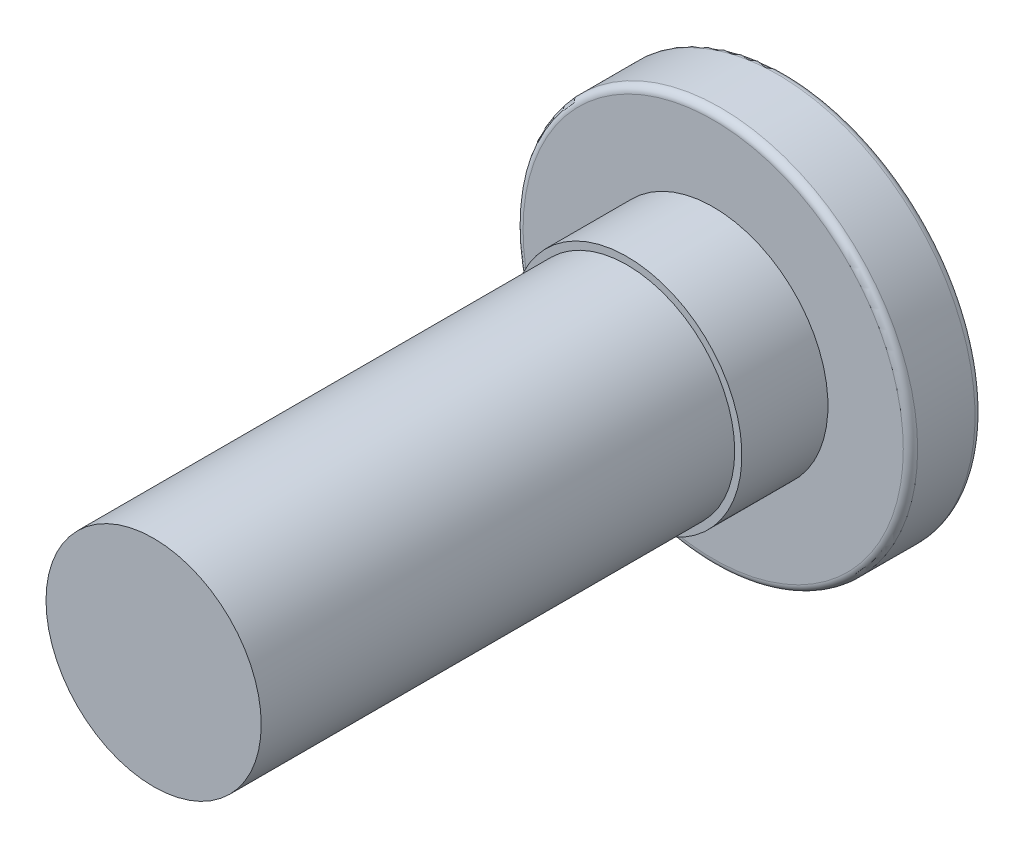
ISO-10303-21;
HEADER;
FILE_DESCRIPTION(('STEP AP214'),'2;1');
FILE_NAME('part.step','',(''),(''),'','','');
FILE_SCHEMA(('AUTOMOTIVE_DESIGN { 1 0 10303 214 1 1 1 1 }'));
ENDSEC;
DATA;
#1=APPLICATION_CONTEXT('core data for automotive mechanical design processes');
#2=APPLICATION_PROTOCOL_DEFINITION('international standard','automotive_design',2000,#1);
#3=PRODUCT_CONTEXT('',#1,'mechanical');
#4=PRODUCT('Part','Part','',(#3));
#5=PRODUCT_RELATED_PRODUCT_CATEGORY('part','',(#4));
#6=PRODUCT_DEFINITION_FORMATION('','',#4);
#7=PRODUCT_DEFINITION_CONTEXT('part definition',#1,'design');
#8=PRODUCT_DEFINITION('design','',#6,#7);
#9=PRODUCT_DEFINITION_SHAPE('','',#8);
#10=(LENGTH_UNIT() NAMED_UNIT(*) SI_UNIT(.MILLI.,.METRE.));
#11=(NAMED_UNIT(*) PLANE_ANGLE_UNIT() SI_UNIT($,.RADIAN.));
#12=(NAMED_UNIT(*) SI_UNIT($,.STERADIAN.) SOLID_ANGLE_UNIT());
#13=UNCERTAINTY_MEASURE_WITH_UNIT(LENGTH_MEASURE(1.E-05),#10,'distance_accuracy_value','');
#14=(GEOMETRIC_REPRESENTATION_CONTEXT(3) GLOBAL_UNCERTAINTY_ASSIGNED_CONTEXT((#13)) GLOBAL_UNIT_ASSIGNED_CONTEXT((#10,
#11,#12)) REPRESENTATION_CONTEXT('',''));
#15=CARTESIAN_POINT('',(0.,0.,0.));
#16=DIRECTION('',(0.,0.,1.));
#17=DIRECTION('',(1.,0.,0.));
#18=AXIS2_PLACEMENT_3D('',#15,#16,#17);
#19=CARTESIAN_POINT('',(0.,0.,1.));
#20=DIRECTION('',(0.,0.,1.));
#21=DIRECTION('',(1.,0.,0.));
#22=AXIS2_PLACEMENT_3D('',#19,#20,#21);
#23=PLANE('',#22);
#24=DIRECTION('',(0.,-1.,0.));
#25=VECTOR('',#24,1.);
#26=CARTESIAN_POINT('',(0.999999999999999,-0.577350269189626,1.));
#27=LINE('',#26,#25);
#28=CARTESIAN_POINT('',(0.999999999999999,-0.577350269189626,1.));
#29=VERTEX_POINT('',#28);
#30=CARTESIAN_POINT('',(0.999999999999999,0.577350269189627,1.));
#31=VERTEX_POINT('',#30);
#32=EDGE_CURVE('E84',#29,#31,#27,.F.);
#33=ORIENTED_EDGE('',*,*,#32,.F.);
#34=DIRECTION('',(-0.866025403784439,-0.5,0.));
#35=VECTOR('',#34,1.);
#36=CARTESIAN_POINT('',(0.,-1.15470053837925,1.));
#37=LINE('',#36,#35);
#38=CARTESIAN_POINT('',(0.,-1.15470053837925,1.));
#39=VERTEX_POINT('',#38);
#40=EDGE_CURVE('E81',#39,#29,#37,.F.);
#41=ORIENTED_EDGE('',*,*,#40,.F.);
#42=DIRECTION('',(-0.866025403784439,0.5,0.));
#43=VECTOR('',#42,1.);
#44=CARTESIAN_POINT('',(-1.,-0.577350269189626,1.));
#45=LINE('',#44,#43);
#46=CARTESIAN_POINT('',(-1.,-0.577350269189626,1.));
#47=VERTEX_POINT('',#46);
#48=EDGE_CURVE('E98',#47,#39,#45,.F.);
#49=ORIENTED_EDGE('',*,*,#48,.F.);
#50=DIRECTION('',(0.,1.,0.));
#51=VECTOR('',#50,1.);
#52=CARTESIAN_POINT('',(-1.,0.577350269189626,1.));
#53=LINE('',#52,#51);
#54=CARTESIAN_POINT('',(-1.,0.577350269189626,1.));
#55=VERTEX_POINT('',#54);
#56=EDGE_CURVE('E194',#55,#47,#53,.F.);
#57=ORIENTED_EDGE('',*,*,#56,.F.);
#58=DIRECTION('',(0.866025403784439,0.5,0.));
#59=VECTOR('',#58,1.);
#60=CARTESIAN_POINT('',(0.,1.15470053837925,1.));
#61=LINE('',#60,#59);
#62=CARTESIAN_POINT('',(0.,1.15470053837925,1.));
#63=VERTEX_POINT('',#62);
#64=EDGE_CURVE('E188',#63,#55,#61,.F.);
#65=ORIENTED_EDGE('',*,*,#64,.F.);
#66=DIRECTION('',(0.866025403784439,-0.5,0.));
#67=VECTOR('',#66,1.);
#68=CARTESIAN_POINT('',(0.999999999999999,0.577350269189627,1.));
#69=LINE('',#68,#67);
#70=EDGE_CURVE('E87',#31,#63,#69,.F.);
#71=ORIENTED_EDGE('',*,*,#70,.F.);
#72=EDGE_LOOP('',(#33,#41,#49,#57,#65,#71));
#73=FACE_BOUND('',#72,.T.);
#74=ADVANCED_FACE('F17',(#73),#23,.F.);
#75=CARTESIAN_POINT('',(0.999999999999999,-0.577350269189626,1.));
#76=DIRECTION('',(-1.,0.,0.));
#77=DIRECTION('',(0.,-1.,0.));
#78=AXIS2_PLACEMENT_3D('',#75,#76,#77);
#79=PLANE('',#78);
#80=ORIENTED_EDGE('',*,*,#32,.T.);
#81=DIRECTION('',(0.,0.,1.));
#82=VECTOR('',#81,1.);
#83=CARTESIAN_POINT('',(0.999999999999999,0.577350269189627,1.));
#84=LINE('',#83,#82);
#85=CARTESIAN_POINT('',(0.999999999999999,0.577350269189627,0.));
#86=VERTEX_POINT('',#85);
#87=EDGE_CURVE('E183',#86,#31,#84,.T.);
#88=ORIENTED_EDGE('',*,*,#87,.F.);
#89=DIRECTION('',(0.,1.,0.));
#90=VECTOR('',#89,1.);
#91=CARTESIAN_POINT('',(0.999999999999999,0.,0.));
#92=LINE('',#91,#90);
#93=CARTESIAN_POINT('',(0.999999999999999,-0.577350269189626,0.));
#94=VERTEX_POINT('',#93);
#95=EDGE_CURVE('E95',#86,#94,#92,.F.);
#96=ORIENTED_EDGE('',*,*,#95,.T.);
#97=DIRECTION('',(0.,0.,1.));
#98=VECTOR('',#97,1.);
#99=CARTESIAN_POINT('',(0.999999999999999,-0.577350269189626,1.));
#100=LINE('',#99,#98);
#101=EDGE_CURVE('E92',#29,#94,#100,.F.);
#102=ORIENTED_EDGE('',*,*,#101,.F.);
#103=EDGE_LOOP('',(#80,#88,#96,#102));
#104=FACE_BOUND('',#103,.T.);
#105=ADVANCED_FACE('F93',(#104),#79,.T.);
#106=CARTESIAN_POINT('',(0.,-1.15470053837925,1.));
#107=DIRECTION('',(-0.5,0.866025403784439,0.));
#108=DIRECTION('',(-0.866025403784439,-0.5,0.));
#109=AXIS2_PLACEMENT_3D('',#106,#107,#108);
#110=PLANE('',#109);
#111=ORIENTED_EDGE('',*,*,#40,.T.);
#112=ORIENTED_EDGE('',*,*,#101,.T.);
#113=DIRECTION('',(-0.866025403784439,-0.5,0.));
#114=VECTOR('',#113,1.);
#115=CARTESIAN_POINT('',(0.999999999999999,-0.577350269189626,0.));
#116=LINE('',#115,#114);
#117=CARTESIAN_POINT('',(0.,-1.15470053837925,0.));
#118=VERTEX_POINT('',#117);
#119=EDGE_CURVE('E220',#94,#118,#116,.T.);
#120=ORIENTED_EDGE('',*,*,#119,.T.);
#121=DIRECTION('',(0.,0.,1.));
#122=VECTOR('',#121,1.);
#123=CARTESIAN_POINT('',(0.,-1.15470053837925,1.));
#124=LINE('',#123,#122);
#125=EDGE_CURVE('E102',#39,#118,#124,.F.);
#126=ORIENTED_EDGE('',*,*,#125,.F.);
#127=EDGE_LOOP('',(#111,#112,#120,#126));
#128=FACE_BOUND('',#127,.T.);
#129=ADVANCED_FACE('F100',(#128),#110,.T.);
#130=CARTESIAN_POINT('',(-1.,-0.577350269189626,1.));
#131=DIRECTION('',(0.5,0.866025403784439,0.));
#132=DIRECTION('',(-0.866025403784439,0.5,0.));
#133=AXIS2_PLACEMENT_3D('',#130,#131,#132);
#134=PLANE('',#133);
#135=ORIENTED_EDGE('',*,*,#48,.T.);
#136=ORIENTED_EDGE('',*,*,#125,.T.);
#137=DIRECTION('',(-0.866025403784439,0.5,0.));
#138=VECTOR('',#137,1.);
#139=CARTESIAN_POINT('',(0.,-1.15470053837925,0.));
#140=LINE('',#139,#138);
#141=CARTESIAN_POINT('',(-1.,-0.577350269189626,0.));
#142=VERTEX_POINT('',#141);
#143=EDGE_CURVE('E221',#118,#142,#140,.T.);
#144=ORIENTED_EDGE('',*,*,#143,.T.);
#145=DIRECTION('',(0.,0.,1.));
#146=VECTOR('',#145,1.);
#147=CARTESIAN_POINT('',(-1.,-0.577350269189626,1.));
#148=LINE('',#147,#146);
#149=EDGE_CURVE('E191',#47,#142,#148,.F.);
#150=ORIENTED_EDGE('',*,*,#149,.F.);
#151=EDGE_LOOP('',(#135,#136,#144,#150));
#152=FACE_BOUND('',#151,.T.);
#153=ADVANCED_FACE('F199',(#152),#134,.T.);
#154=CARTESIAN_POINT('',(-1.,0.577350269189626,1.));
#155=DIRECTION('',(1.,0.,0.));
#156=DIRECTION('',(0.,1.,0.));
#157=AXIS2_PLACEMENT_3D('',#154,#155,#156);
#158=PLANE('',#157);
#159=ORIENTED_EDGE('',*,*,#56,.T.);
#160=ORIENTED_EDGE('',*,*,#149,.T.);
#161=DIRECTION('',(0.,1.,0.));
#162=VECTOR('',#161,1.);
#163=CARTESIAN_POINT('',(-1.,0.,0.));
#164=LINE('',#163,#162);
#165=CARTESIAN_POINT('',(-1.,0.577350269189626,0.));
#166=VERTEX_POINT('',#165);
#167=EDGE_CURVE('E206',#142,#166,#164,.T.);
#168=ORIENTED_EDGE('',*,*,#167,.T.);
#169=DIRECTION('',(0.,0.,1.));
#170=VECTOR('',#169,1.);
#171=CARTESIAN_POINT('',(-1.,0.577350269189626,1.));
#172=LINE('',#171,#170);
#173=EDGE_CURVE('E185',#55,#166,#172,.F.);
#174=ORIENTED_EDGE('',*,*,#173,.F.);
#175=EDGE_LOOP('',(#159,#160,#168,#174));
#176=FACE_BOUND('',#175,.T.);
#177=ADVANCED_FACE('F204',(#176),#158,.T.);
#178=CARTESIAN_POINT('',(0.,1.15470053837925,1.));
#179=DIRECTION('',(0.5,-0.866025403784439,0.));
#180=DIRECTION('',(0.866025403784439,0.5,0.));
#181=AXIS2_PLACEMENT_3D('',#178,#179,#180);
#182=PLANE('',#181);
#183=ORIENTED_EDGE('',*,*,#64,.T.);
#184=ORIENTED_EDGE('',*,*,#173,.T.);
#185=DIRECTION('',(0.866025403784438,0.5,0.));
#186=VECTOR('',#185,1.);
#187=CARTESIAN_POINT('',(-1.,0.577350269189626,0.));
#188=LINE('',#187,#186);
#189=CARTESIAN_POINT('',(0.,1.15470053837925,0.));
#190=VERTEX_POINT('',#189);
#191=EDGE_CURVE('E210',#166,#190,#188,.T.);
#192=ORIENTED_EDGE('',*,*,#191,.T.);
#193=DIRECTION('',(0.,0.,1.));
#194=VECTOR('',#193,1.);
#195=CARTESIAN_POINT('',(0.,1.15470053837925,1.));
#196=LINE('',#195,#194);
#197=EDGE_CURVE('E174',#63,#190,#196,.F.);
#198=ORIENTED_EDGE('',*,*,#197,.F.);
#199=EDGE_LOOP('',(#183,#184,#192,#198));
#200=FACE_BOUND('',#199,.T.);
#201=ADVANCED_FACE('F209',(#200),#182,.T.);
#202=CARTESIAN_POINT('',(0.999999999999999,0.577350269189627,1.));
#203=DIRECTION('',(-0.5,-0.866025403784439,0.));
#204=DIRECTION('',(0.866025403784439,-0.5,0.));
#205=AXIS2_PLACEMENT_3D('',#202,#203,#204);
#206=PLANE('',#205);
#207=ORIENTED_EDGE('',*,*,#70,.T.);
#208=ORIENTED_EDGE('',*,*,#197,.T.);
#209=DIRECTION('',(0.866025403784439,-0.5,0.));
#210=VECTOR('',#209,1.);
#211=CARTESIAN_POINT('',(0.,1.15470053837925,0.));
#212=LINE('',#211,#210);
#213=EDGE_CURVE('E215',#190,#86,#212,.T.);
#214=ORIENTED_EDGE('',*,*,#213,.T.);
#215=ORIENTED_EDGE('',*,*,#87,.T.);
#216=EDGE_LOOP('',(#207,#208,#214,#215));
#217=FACE_BOUND('',#216,.T.);
#218=ADVANCED_FACE('F214',(#217),#206,.T.);
#219=CARTESIAN_POINT('',(0.,0.,0.));
#220=DIRECTION('',(0.,0.,1.));
#221=DIRECTION('',(1.,0.,0.));
#222=AXIS2_PLACEMENT_3D('',#219,#220,#221);
#223=PLANE('',#222);
#224=ORIENTED_EDGE('',*,*,#191,.F.);
#225=ORIENTED_EDGE('',*,*,#167,.F.);
#226=ORIENTED_EDGE('',*,*,#143,.F.);
#227=ORIENTED_EDGE('',*,*,#119,.F.);
#228=ORIENTED_EDGE('',*,*,#95,.F.);
#229=ORIENTED_EDGE('',*,*,#213,.F.);
#230=EDGE_LOOP('',(#224,#225,#226,#227,#228,#229));
#231=FACE_BOUND('',#230,.T.);
#232=CARTESIAN_POINT('',(0.,0.,0.));
#233=DIRECTION('',(0.,0.,1.));
#234=DIRECTION('',(1.,0.,0.));
#235=AXIS2_PLACEMENT_3D('',#232,#233,#234);
#236=CIRCLE('',#235,2.65);
#237=CARTESIAN_POINT('',(2.65,0.,0.));
#238=VERTEX_POINT('',#237);
#239=CARTESIAN_POINT('',(-2.65,0.,0.));
#240=VERTEX_POINT('',#239);
#241=EDGE_CURVE('E217',#238,#240,#236,.T.);
#242=ORIENTED_EDGE('',*,*,#241,.F.);
#243=CARTESIAN_POINT('',(0.,0.,0.));
#244=DIRECTION('',(0.,0.,1.));
#245=DIRECTION('',(-1.,0.,0.));
#246=AXIS2_PLACEMENT_3D('',#243,#244,#245);
#247=CIRCLE('',#246,2.65);
#248=EDGE_CURVE('E237',#240,#238,#247,.T.);
#249=ORIENTED_EDGE('',*,*,#248,.F.);
#250=EDGE_LOOP('',(#242,#249));
#251=FACE_BOUND('',#250,.T.);
#252=ADVANCED_FACE('F162',(#231,#251),#223,.F.);
#253=CARTESIAN_POINT('',(0.,0.,0.1));
#254=DIRECTION('',(0.,0.,1.));
#255=DIRECTION('',(1.,0.,0.));
#256=AXIS2_PLACEMENT_3D('',#253,#254,#255);
#257=TOROIDAL_SURFACE('',#256,2.65,0.1);
#258=ORIENTED_EDGE('',*,*,#241,.T.);
#259=ORIENTED_EDGE('',*,*,#248,.T.);
#260=EDGE_LOOP('',(#258,#259));
#261=FACE_BOUND('',#260,.T.);
#262=CARTESIAN_POINT('',(0.,0.,0.1));
#263=DIRECTION('',(0.,0.,-1.));
#264=DIRECTION('',(-1.,0.,0.));
#265=AXIS2_PLACEMENT_3D('',#262,#263,#264);
#266=CIRCLE('',#265,2.75);
#267=CARTESIAN_POINT('',(-2.75,0.,0.1));
#268=VERTEX_POINT('',#267);
#269=EDGE_CURVE('E154',#268,#268,#266,.F.);
#270=ORIENTED_EDGE('',*,*,#269,.F.);
#271=EDGE_LOOP('',(#270));
#272=FACE_BOUND('',#271,.T.);
#273=ADVANCED_FACE('F158',(#261,#272),#257,.T.);
#274=CARTESIAN_POINT('',(0.,0.,1.));
#275=DIRECTION('',(0.,0.,-1.));
#276=DIRECTION('',(-1.,0.,0.));
#277=AXIS2_PLACEMENT_3D('',#274,#275,#276);
#278=CYLINDRICAL_SURFACE('',#277,2.75);
#279=CARTESIAN_POINT('',(0.,0.,0.9));
#280=DIRECTION('',(0.,0.,1.));
#281=DIRECTION('',(1.,0.,0.));
#282=AXIS2_PLACEMENT_3D('',#279,#280,#281);
#283=CIRCLE('',#282,2.75);
#284=CARTESIAN_POINT('',(2.75,0.,0.9));
#285=VERTEX_POINT('',#284);
#286=EDGE_CURVE('E146',#285,#285,#283,.T.);
#287=ORIENTED_EDGE('',*,*,#286,.F.);
#288=EDGE_LOOP('',(#287));
#289=FACE_BOUND('',#288,.T.);
#290=ORIENTED_EDGE('',*,*,#269,.T.);
#291=EDGE_LOOP('',(#290));
#292=FACE_BOUND('',#291,.T.);
#293=ADVANCED_FACE('F132',(#289,#292),#278,.T.);
#294=CARTESIAN_POINT('',(0.,0.,0.9));
#295=DIRECTION('',(0.,0.,1.));
#296=DIRECTION('',(1.,0.,0.));
#297=AXIS2_PLACEMENT_3D('',#294,#295,#296);
#298=TOROIDAL_SURFACE('',#297,2.65,0.1);
#299=ORIENTED_EDGE('',*,*,#286,.T.);
#300=EDGE_LOOP('',(#299));
#301=FACE_BOUND('',#300,.T.);
#302=CARTESIAN_POINT('',(0.,0.,1.));
#303=DIRECTION('',(0.,0.,-1.));
#304=DIRECTION('',(1.,0.,0.));
#305=AXIS2_PLACEMENT_3D('',#302,#303,#304);
#306=CIRCLE('',#305,2.65);
#307=CARTESIAN_POINT('',(-2.65,0.,1.));
#308=VERTEX_POINT('',#307);
#309=CARTESIAN_POINT('',(2.65,0.,1.));
#310=VERTEX_POINT('',#309);
#311=EDGE_CURVE('E36',#308,#310,#306,.F.);
#312=ORIENTED_EDGE('',*,*,#311,.F.);
#313=CARTESIAN_POINT('',(0.,0.,1.));
#314=DIRECTION('',(0.,0.,-1.));
#315=DIRECTION('',(-1.,0.,0.));
#316=AXIS2_PLACEMENT_3D('',#313,#314,#315);
#317=CIRCLE('',#316,2.65);
#318=EDGE_CURVE('E116',#310,#308,#317,.F.);
#319=ORIENTED_EDGE('',*,*,#318,.F.);
#320=EDGE_LOOP('',(#312,#319));
#321=FACE_BOUND('',#320,.T.);
#322=ADVANCED_FACE('F120',(#301,#321),#298,.T.);
#323=CARTESIAN_POINT('',(0.,0.,1.));
#324=DIRECTION('',(0.,0.,1.));
#325=DIRECTION('',(1.,0.,0.));
#326=AXIS2_PLACEMENT_3D('',#323,#324,#325);
#327=PLANE('',#326);
#328=CARTESIAN_POINT('',(0.,0.,1.));
#329=DIRECTION('',(0.,0.,-1.));
#330=DIRECTION('',(-1.,0.,0.));
#331=AXIS2_PLACEMENT_3D('',#328,#329,#330);
#332=CIRCLE('',#331,1.6);
#333=CARTESIAN_POINT('',(-1.6,0.,1.));
#334=VERTEX_POINT('',#333);
#335=EDGE_CURVE('E112',#334,#334,#332,.F.);
#336=ORIENTED_EDGE('',*,*,#335,.F.);
#337=EDGE_LOOP('',(#336));
#338=FACE_BOUND('',#337,.T.);
#339=ORIENTED_EDGE('',*,*,#318,.T.);
#340=ORIENTED_EDGE('',*,*,#311,.T.);
#341=EDGE_LOOP('',(#339,#340));
#342=FACE_BOUND('',#341,.T.);
#343=ADVANCED_FACE('F131',(#338,#342),#327,.T.);
#344=CARTESIAN_POINT('',(0.,0.,2.2));
#345=DIRECTION('',(0.,0.,-1.));
#346=DIRECTION('',(-1.,0.,0.));
#347=AXIS2_PLACEMENT_3D('',#344,#345,#346);
#348=CYLINDRICAL_SURFACE('',#347,1.6);
#349=ORIENTED_EDGE('',*,*,#335,.T.);
#350=EDGE_LOOP('',(#349));
#351=FACE_BOUND('',#350,.T.);
#352=CARTESIAN_POINT('',(0.,0.,2.2));
#353=DIRECTION('',(0.,0.,-1.));
#354=DIRECTION('',(-1.,0.,0.));
#355=AXIS2_PLACEMENT_3D('',#352,#353,#354);
#356=CIRCLE('',#355,1.6);
#357=CARTESIAN_POINT('',(-1.6,0.,2.2));
#358=VERTEX_POINT('',#357);
#359=EDGE_CURVE('E109',#358,#358,#356,.F.);
#360=ORIENTED_EDGE('',*,*,#359,.F.);
#361=EDGE_LOOP('',(#360));
#362=FACE_BOUND('',#361,.T.);
#363=ADVANCED_FACE('F269',(#351,#362),#348,.T.);
#364=CARTESIAN_POINT('',(0.,0.,8.8));
#365=DIRECTION('',(0.,0.,1.));
#366=DIRECTION('',(1.,0.,0.));
#367=AXIS2_PLACEMENT_3D('',#364,#365,#366);
#368=PLANE('',#367);
#369=CARTESIAN_POINT('',(0.,0.,8.8));
#370=DIRECTION('',(0.,0.,-1.));
#371=DIRECTION('',(-1.,0.,0.));
#372=AXIS2_PLACEMENT_3D('',#369,#370,#371);
#373=CIRCLE('',#372,1.5);
#374=CARTESIAN_POINT('',(-1.5,0.,8.8));
#375=VERTEX_POINT('',#374);
#376=EDGE_CURVE('E28',#375,#375,#373,.T.);
#377=ORIENTED_EDGE('',*,*,#376,.F.);
#378=EDGE_LOOP('',(#377));
#379=FACE_BOUND('',#378,.T.);
#380=ADVANCED_FACE('F263',(#379),#368,.T.);
#381=CARTESIAN_POINT('',(0.,0.,2.2));
#382=DIRECTION('',(0.,0.,1.));
#383=DIRECTION('',(1.,0.,0.));
#384=AXIS2_PLACEMENT_3D('',#381,#382,#383);
#385=PLANE('',#384);
#386=CARTESIAN_POINT('',(0.,0.,2.2));
#387=DIRECTION('',(0.,0.,-1.));
#388=DIRECTION('',(-1.,0.,0.));
#389=AXIS2_PLACEMENT_3D('',#386,#387,#388);
#390=CIRCLE('',#389,1.5);
#391=CARTESIAN_POINT('',(-1.5,0.,2.2));
#392=VERTEX_POINT('',#391);
#393=EDGE_CURVE('E11',#392,#392,#390,.F.);
#394=ORIENTED_EDGE('',*,*,#393,.F.);
#395=EDGE_LOOP('',(#394));
#396=FACE_BOUND('',#395,.T.);
#397=ORIENTED_EDGE('',*,*,#359,.T.);
#398=EDGE_LOOP('',(#397));
#399=FACE_BOUND('',#398,.T.);
#400=ADVANCED_FACE('F257',(#396,#399),#385,.T.);
#401=CARTESIAN_POINT('',(0.,0.,8.8));
#402=DIRECTION('',(0.,0.,-1.));
#403=DIRECTION('',(-1.,0.,0.));
#404=AXIS2_PLACEMENT_3D('',#401,#402,#403);
#405=CYLINDRICAL_SURFACE('',#404,1.5);
#406=ORIENTED_EDGE('',*,*,#393,.T.);
#407=EDGE_LOOP('',(#406));
#408=FACE_BOUND('',#407,.T.);
#409=ORIENTED_EDGE('',*,*,#376,.T.);
#410=EDGE_LOOP('',(#409));
#411=FACE_BOUND('',#410,.T.);
#412=ADVANCED_FACE('F255',(#408,#411),#405,.T.);
#413=CLOSED_SHELL('',(#74,#105,#129,#153,#177,#201,#218,#252,#273,#293,#322,#343,#363,#380,#400,#412));
#414=MANIFOLD_SOLID_BREP('B1',#413);
#415=ADVANCED_BREP_SHAPE_REPRESENTATION('',(#18,#414),#14);
#416=SHAPE_DEFINITION_REPRESENTATION(#9,#415);
ENDSEC;
END-ISO-10303-21;
